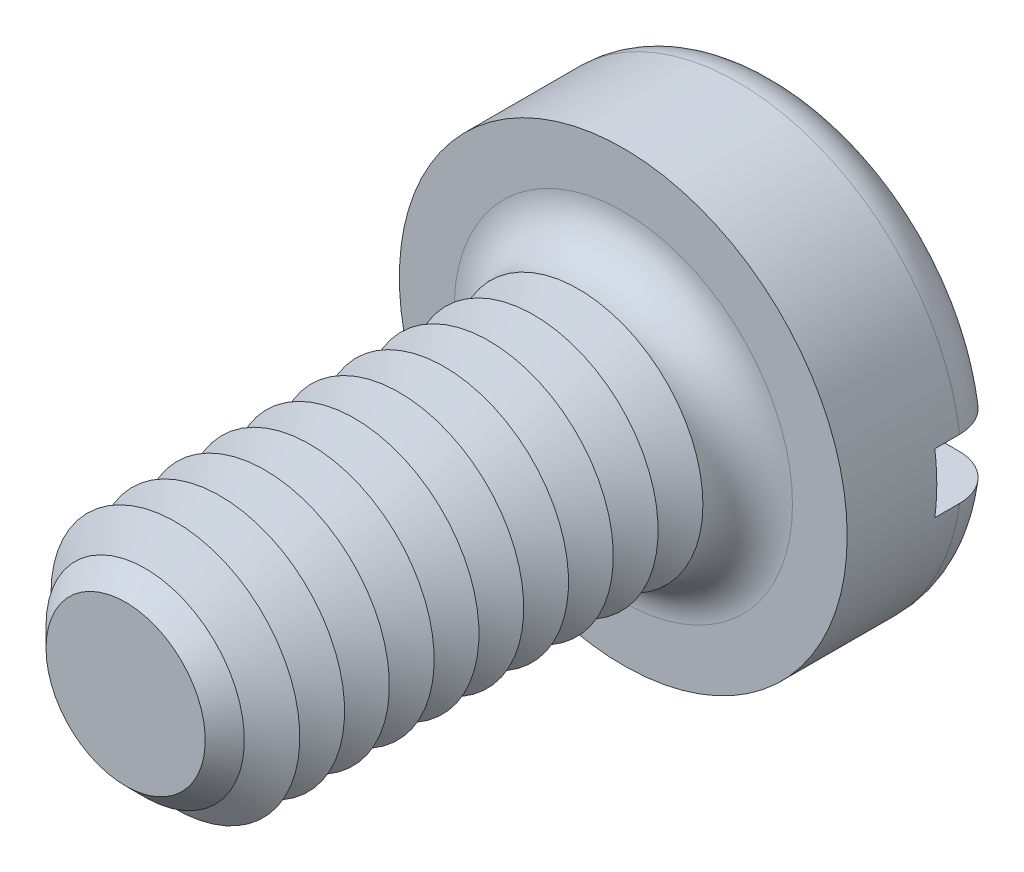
from build123d import *

# Parameters (mm, degrees)
SKETCH3_R           = 2.25
BOSS_EXTRUDE2_DEPTH = 1.6
SKETCH4_R           = 1.25
BOSS_EXTRUDE3_DEPTH = 5
FILLET1_R           = 0.45
CHAMFER1_SIZE       = 0.45
LPATTERN1_COUNT     = 10
LPATTERN1_PITCH     = 0.45
SKETCH8_W           = 4.5
SKETCH8_H           = 0.6
CUT_EXTRUDE1_DEPTH  = 0.7


with BuildPart() as part:
    # Sketch3 → Boss-Extrude2 (new body)
    with BuildSketch(Plane.XY):
        Circle(SKETCH3_R)
    extrude(amount=-BOSS_EXTRUDE2_DEPTH)

    # Sketch4 → Boss-Extrude3 (add)
    with BuildSketch(Plane.XY):
        Circle(SKETCH4_R)
    extrude(amount=BOSS_EXTRUDE3_DEPTH)

    # Fillet1
    fillet1_edges = [part.edges().sort_by_distance(p)[0] for p in [
        (-2.25, 0, -1.6),
        (-1.25, 0, 0),
    ]]
    fillet(fillet1_edges, radius=FILLET1_R)

    # Chamfer1
    chamfer1_edges = [part.edges().sort_by_distance(p)[0] for p in [
        (-1.25, 0, 5),
    ]]
    chamfer(chamfer1_edges, length=CHAMFER1_SIZE)

    # Sketch6 → Cut-Revolve1 (revolve, cut)
    with BuildSketch(Plane(origin=(0, 0, 0), x_dir=(0, 0, -1), z_dir=(1, 0, 0)), mode=Mode.PRIVATE) as cut_revolve1_sk:
        Polygon((-0.45, 1.25), (-0.675, 0.860288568), (-0.9, 1.25), align=None)
    cut_revolve1 = revolve(cut_revolve1_sk.sketch.rotate(Axis((0, 0, -1.694361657), (0, 0, 1)), 90), axis=Axis((0, 0, -1.694361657), (0, 0, 1)), mode=Mode.SUBTRACT)

    # LPattern1: Cut-Revolve1 ×10
    with Locations(*[(0, 0, i * LPATTERN1_PITCH) for i in range(1, LPATTERN1_COUNT)]):
        add(cut_revolve1, mode=Mode.SUBTRACT)

    # Sketch8 → Cut-Extrude1 (cut)
    with BuildSketch(Plane(origin=(0, 0, -1.6), x_dir=(-1, 0, 0), z_dir=(0, 0, -1))):
        Rectangle(SKETCH8_W, SKETCH8_H)
    extrude(amount=-CUT_EXTRUDE1_DEPTH, mode=Mode.SUBTRACT)


solid = part.part
